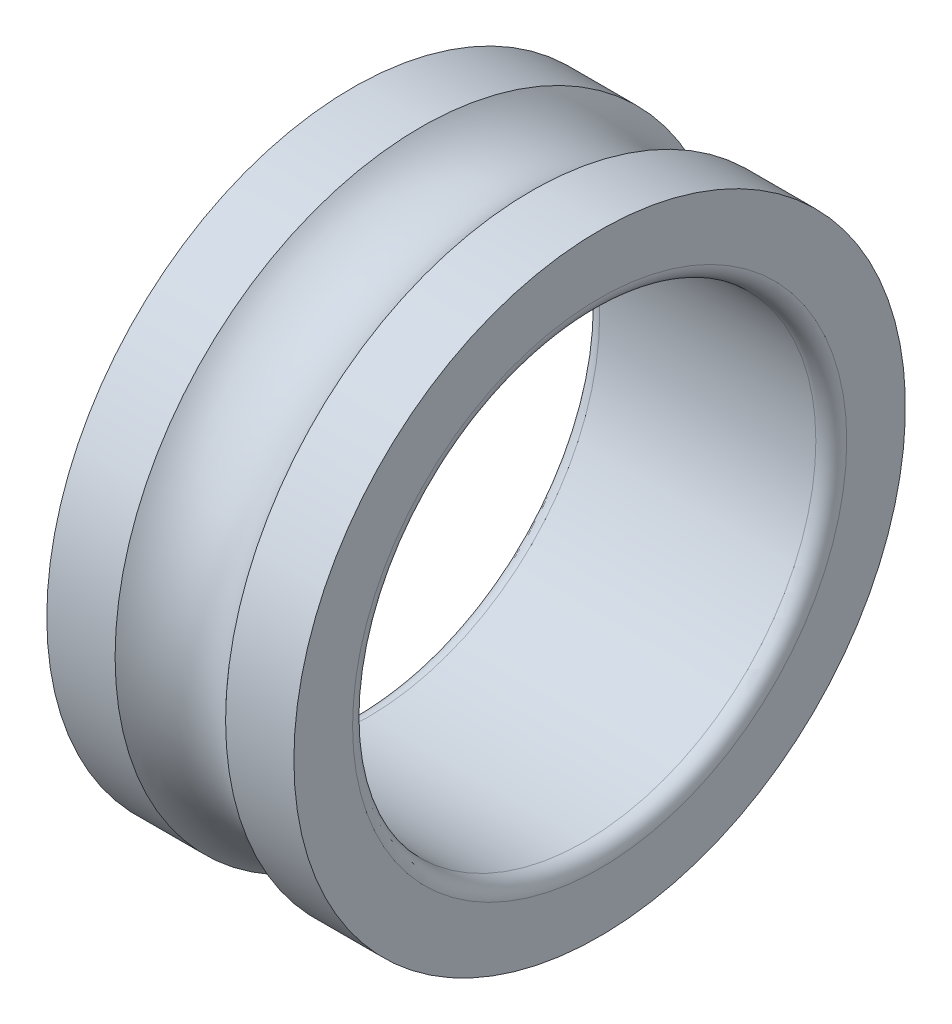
from build123d import *


with BuildPart() as part:
    # Esquisse1 → Base-R_volution (revolve)
    with BuildSketch(Plane(origin=(0, 0, 0), x_dir=(1, 0, 0), z_dir=(0, 1, 0)), mode=Mode.PRIVATE) as base_r_volution_sk:
        with BuildLine():
            Line((0, 19.8), (0, 16))
            ThreePointArc((0, 16), (0.292893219, 15.292893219), (1, 15))
            Line((1, 15), (15, 15))
            ThreePointArc((15, 15), (15.707106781, 15.292893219), (16, 16))
            Line((16, 16), (16, 19.8))
            Line((16, 19.8), (11.577708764, 19.8))
            ThreePointArc((11.577708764, 19.8), (8, 18.2), (4.422291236, 19.8))
            Line((4.422291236, 19.8), (0, 19.8))
        make_face()
    revolve(base_r_volution_sk.sketch.rotate(Axis((0, 0, 0), (1, 0, 0)), 180), axis=Axis((0, 0, 0), (1, 0, 0)))


solid = part.part
